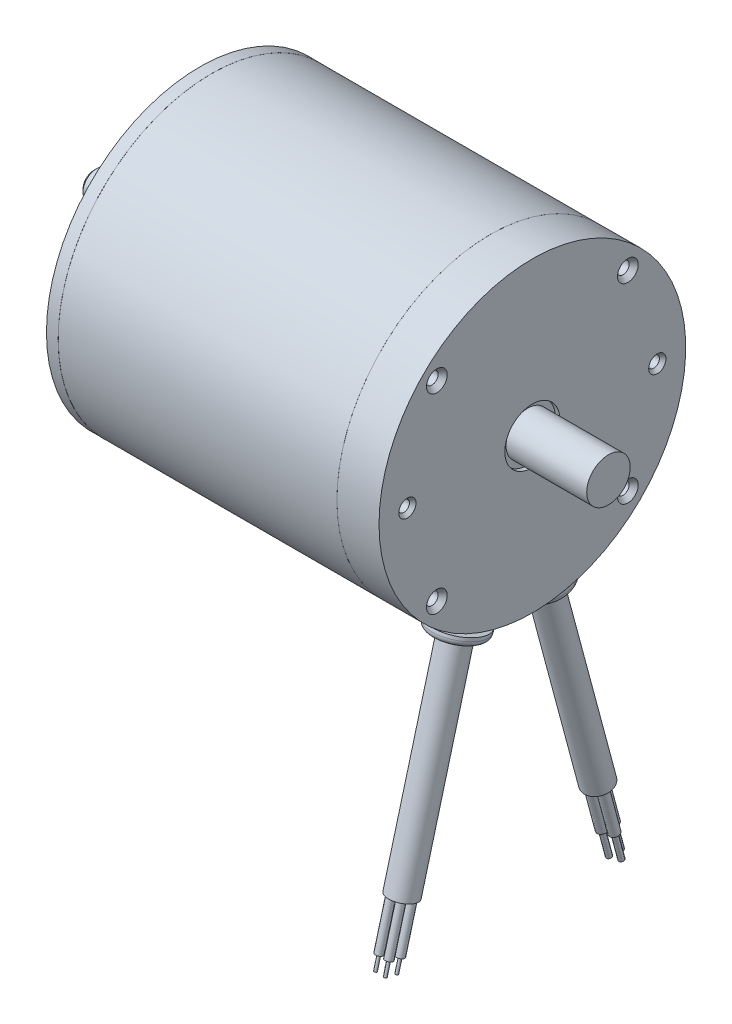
from build123d import *

# Parameters (mm, degrees)
CHAMFER1_SIZE            = 0.508
FILLET1_R                = 0.25
FILLET2_R                = 0.13
CIRPATTERN2_COUNT        = 2
CIRPATTERN3_COUNT        = 4
CIRPATTERN4_COUNT        = 4
SKETCH22_R               = 3.175
CUT_EXTRUDE2_DEPTH       = 0.75
CUT_EXTRUDE3_DEPTH       = 1.75
CIRPATTERN1_COUNT        = 4
SKETCH28_R               = 3.175
BOSS_EXTRUDE3_DEPTH      = 1.5
SKETCH29_R               = 4.7625
BOSS_EXTRUDE4_DEPTH      = 1.588
SKETCH30_R               = 2.54
BOSS_EXTRUDE5_DEPTH      = 38.291
FILLET4_R                = 1
SKETCH31_R               = 2.15
CUT_EXTRUDE4_DEPTH       = 38.291
CIRPATTERN7_COUNT        = 2
CIRPATTERN7_ANGLE        = 330
FILLET4_OF_CIRPATTERN7_R = 1
SKETCH32_R               = 0.889
BOSS_EXTRUDE6_DEPTH      = 47
SKETCH33_R               = 0.6985
BOSS_EXTRUDE7_DEPTH      = 47
SKETCH34_R               = 0.4825
BOSS_EXTRUDE8_DEPTH      = 5.08
SKETCH35_R               = 0.254
BOSS_EXTRUDE9_DEPTH      = 2.54


with BuildPart() as part:
    # Sketch1 → Revolve1 (revolve)
    with BuildSketch(Plane.XY, mode=Mode.PRIVATE) as revolve1_sk:
        Polygon((0, 0), (0, 2.5), (21.12, 2.5), (21.12, 11.006), (20.92, 11.006), (20.92, 9.4), (17.5, 9.4), (17.5, 12.5), (19.5, 12.5), (19.5, 28.22), (80.7, 28.22), (80.7, 5.08), (79.86, 5.08), (79.86, 4), (94.7, 4), (94.7, 0), align=None)
    revolve(revolve1_sk.sketch.rotate(Axis((0, 0, 0), (1, 0, 0)), 90), axis=Axis((0, 0, 0), (1, 0, 0)))

    # Chamfer1
    chamfer1_edges = [part.edges().sort_by_distance(p)[0] for p in [
        (0, 0, -2.5),
    ]]
    chamfer(chamfer1_edges, length=CHAMFER1_SIZE)

    # Fillet1
    fillet1_edges = [part.edges().sort_by_distance(p)[0] for p in [
        (17.5, 0, -12.5),
    ]]
    fillet(fillet1_edges, radius=FILLET1_R)

    # Fillet2
    fillet2_edges = [part.edges().sort_by_distance(p)[0] for p in [
        (17.5, 0, -9.4),
    ]]
    fillet(fillet2_edges, radius=FILLET2_R)

    # Sketch2 → Cut-Revolve1 (revolve, cut)
    with BuildSketch(Plane.XY, mode=Mode.PRIVATE) as cut_revolve1_sk:
        Polygon((72.9465, 28.22), (72.9535, 28.22), (72.95, 28.213937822), align=None)
        Polygon((21.663753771, 28.22), (21.66, 28.213798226), (21.656753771, 28.22), align=None)
    revolve(cut_revolve1_sk.sketch.rotate(Axis((0, 0, 0), (-1, 0, 0)), 90), axis=Axis((0, 0, 0), (-1, 0, 0)), mode=Mode.SUBTRACT)

    # Sketch25 → Cut-Revolve2 (revolve, cut)
    with BuildSketch(Plane.XY, mode=Mode.PRIVATE) as cut_revolve2_sk:
        Polygon((21.12, 6.577215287), (21.12, 5.886771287), (21.446745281, 5.560026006), (21.446745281, 2.737783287), (22.736248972, 2.737783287), (22.736248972, 2.5), (20.92, 2.5), (20.92, 9.364596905), (21.446745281, 9.364596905), (21.446745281, 6.903960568), align=None)
    revolve(cut_revolve2_sk.sketch.rotate(Axis((0, 0, 0), (-1, 0, 0)), 90), axis=Axis((0, 0, 0), (-1, 0, 0)), mode=Mode.SUBTRACT)

    # Sketch11 → 4-40 Tapped Hole2 (revolve, cut)
    with BuildSketch(Plane(origin=(80.7, 17.575139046, 17.575139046), x_dir=(0, 0, -1), z_dir=(0, 1, 0))):
        Polygon((0, 0), (0, 8.274152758), (1.1303, 7.595), (1.1303, 0.891190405), (1.905, 0), align=None)
    f_4_40_tapped_hole2 = revolve(axis=Axis((87.05, 17.575139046, 17.575139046), (-1, 0, 0)), mode=Mode.SUBTRACT)

    # Sketch15 → M2.5x0.45 Tapped Hole2 (revolve, cut)
    with BuildSketch(Plane(origin=(80.7, 0, 23), x_dir=(0, 0, -1), z_dir=(0, 1, 0))):
        Polygon((0, 0), (0, 6.965882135), (1.025, 6.35), (1.025, 0.64995815), (1.59, 0), align=None)
    m2_5x0_45_tapped_hole2 = revolve(axis=Axis((87.05, 0, 23), (-1, 0, 0)), mode=Mode.SUBTRACT)

    # CirPattern2: M2.5x0.45 Tapped Hole2 ×2 about axis
    cirpattern2_axis = Axis((0, 0, 0), (1, 0, 0))
    for i in range(1, CIRPATTERN2_COUNT):
        add(m2_5x0_45_tapped_hole2.rotate(cirpattern2_axis, i * 360 / CIRPATTERN2_COUNT), mode=Mode.SUBTRACT)

    # CirPattern3: 4-40 Tapped Hole2 ×4 about axis
    cirpattern3_axis = Axis((0, 0, 0), (1, 0, 0))
    for i in range(1, CIRPATTERN3_COUNT):
        add(f_4_40_tapped_hole2.rotate(cirpattern3_axis, i * 360 / CIRPATTERN3_COUNT), mode=Mode.SUBTRACT)

    # Sketch18 → M4x0.7 Tapped Hole1 (revolve, cut)
    with BuildSketch(Plane(origin=(19.5, 21, 0), x_dir=(0, 0, 1), z_dir=(0, 1, 0))):
        Polygon((0, 0), (0, 11.091420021), (1.65, 10.1), (1.65, 0.431388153), (2.025, 0), align=None)
    m4x0_7_tapped_hole1 = revolve(axis=Axis((13.15, 21, 0), (1, 0, 0)), mode=Mode.SUBTRACT)

    # CirPattern4: M4x0.7 Tapped Hole1 ×4 about axis
    cirpattern4_axis = Axis((0, 0, 0), (1, 0, 0))
    for i in range(1, CIRPATTERN4_COUNT):
        add(m4x0_7_tapped_hole1.rotate(cirpattern4_axis, i * 360 / CIRPATTERN4_COUNT), mode=Mode.SUBTRACT)

    # Sketch22 → Cut-Extrude2 (cut)
    with BuildSketch(Plane.ZY.offset(-19.5)):
        with Locations((17.575139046, 17.575139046)):
            Circle(SKETCH22_R)
    cut_extrude2 = extrude(amount=-CUT_EXTRUDE2_DEPTH, mode=Mode.SUBTRACT)

    # Sketch23 → Cut-Extrude3 (cut)
    with BuildSketch(Plane.ZY.offset(-20.25)):
        with BuildLine():
            Line((17.064231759, 18.651731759), (16.605413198, 19.11055032))
            ThreePointArc((16.605413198, 19.11055032), (16.291033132, 18.859244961), (16.039727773, 18.544864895))
            Line((16.039727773, 18.544864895), (16.498546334, 18.086046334))
            ThreePointArc((16.498546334, 18.086046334), (16.628532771, 17.908767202), (16.699194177, 17.700605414))
            Line((16.699194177, 17.700605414), (15.987639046, 17.575139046))
            Line((15.987639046, 17.575139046), (16.699194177, 17.449672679))
            ThreePointArc((16.699194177, 17.449672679), (16.628532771, 17.24151089), (16.498546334, 17.064231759))
            Line((16.498546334, 17.064231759), (16.039727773, 16.605413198))
            ThreePointArc((16.039727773, 16.605413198), (16.291033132, 16.291033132), (16.605413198, 16.039727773))
            Line((16.605413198, 16.039727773), (17.064231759, 16.498546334))
            ThreePointArc((17.064231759, 16.498546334), (17.238958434, 16.627197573), (17.444003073, 16.698171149))
            Line((17.444003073, 16.698171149), (17.575139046, 15.987639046))
            Line((17.575139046, 15.987639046), (17.706275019, 16.698171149))
            ThreePointArc((17.706275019, 16.698171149), (17.911319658, 16.627197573), (18.086046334, 16.498546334))
            Line((18.086046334, 16.498546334), (18.544864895, 16.039727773))
            ThreePointArc((18.544864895, 16.039727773), (18.859244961, 16.291033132), (19.11055032, 16.605413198))
            Line((19.11055032, 16.605413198), (18.651731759, 17.064231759))
            ThreePointArc((18.651731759, 17.064231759), (18.521745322, 17.24151089), (18.451083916, 17.449672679))
            Line((18.451083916, 17.449672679), (19.162639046, 17.575139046))
            Line((19.162639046, 17.575139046), (18.451083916, 17.700605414))
            ThreePointArc((18.451083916, 17.700605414), (18.521745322, 17.908767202), (18.651731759, 18.086046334))
            Line((18.651731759, 18.086046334), (19.11055032, 18.544864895))
            ThreePointArc((19.11055032, 18.544864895), (18.859244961, 18.859244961), (18.544864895, 19.11055032))
            Line((18.544864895, 19.11055032), (18.086046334, 18.651731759))
            ThreePointArc((18.086046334, 18.651731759), (17.911319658, 18.52308052), (17.706275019, 18.452106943))
            Line((17.706275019, 18.452106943), (17.575139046, 19.162639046))
            Line((17.575139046, 19.162639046), (17.444003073, 18.452106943))
            ThreePointArc((17.444003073, 18.452106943), (17.238958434, 18.52308052), (17.064231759, 18.651731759))
        make_face()
    cut_extrude3 = extrude(amount=-CUT_EXTRUDE3_DEPTH, mode=Mode.SUBTRACT)

    # CirPattern1: Cut-Extrude2, Cut-Extrude3 ×4 about axis
    cirpattern1_axis = Axis((0, 0, 0), (1, 0, 0))
    add([cut_extrude2.rotate(cirpattern1_axis, i * 360 / CIRPATTERN1_COUNT) for i in range(1, CIRPATTERN1_COUNT)], mode=Mode.SUBTRACT)
    add([cut_extrude3.rotate(cirpattern1_axis, i * 360 / CIRPATTERN1_COUNT) for i in range(1, CIRPATTERN1_COUNT)], mode=Mode.SUBTRACT)

    # Sketch26 → Revolve2 (revolve)
    with BuildSketch(Plane(origin=(0, 0, 0), x_dir=(1, 0, 0), z_dir=(0, 1, 0))):
        Polygon((21.446745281, 2.737783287), (21.12, 3.064528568), (21.12, 3.591970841), (21.446745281, 3.918716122), align=None)
    revolve(axis=Axis((0, 0, 0), (-1, 0, 0)))

    # Sketch28 → Boss-Extrude3 (add, symmetric)
    with BuildSketch(Plane(origin=(0, -27.258426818, 7.303873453), x_dir=(1, 0, 0), z_dir=(0, -0.9659258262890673, 0.25881904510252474))):
        with Locations(Location((74.712551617, 0, 0), (0, 0, 123.644067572))):
            Circle(SKETCH28_R)
    boss_extrude3 = extrude(amount=BOSS_EXTRUDE3_DEPTH, both=True)

    # Sketch29 → Boss-Extrude4 (add)
    with BuildSketch(Plane(origin=(0, -28.707315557, 7.69210202), x_dir=(1, 0, 0), z_dir=(0, -0.9659258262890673, 0.2588190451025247))):
        with Locations(Location((74.712551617, 0, 0), (0, 0, 270))):
            Circle(SKETCH29_R)
    boss_extrude4 = extrude(amount=BOSS_EXTRUDE4_DEPTH)

    # Sketch30 → Boss-Extrude5 (add)
    with BuildSketch(Plane(origin=(0, -30.241205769, 8.103106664), x_dir=(1, 0, 0), z_dir=(0, -0.9659258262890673, 0.25881904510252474))):
        with Locations(Location((74.712551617, 0, 0), (0, 0, 270))):
            Circle(SKETCH30_R)
    boss_extrude5 = extrude(amount=BOSS_EXTRUDE5_DEPTH)

    # Fillet4
    fillet4_edges = [part.edges().sort_by_distance(p)[0] for p in [
        (74.712551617, -29.008580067, 12.703328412),
    ]]
    fillet(fillet4_edges, radius=FILLET4_R)

    # Sketch31 → Cut-Extrude4 (cut)
    with BuildSketch(Plane(origin=(0, -67.227471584, 18.01354672), x_dir=(1, 0, 0), z_dir=(0, -0.9659258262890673, 0.2588190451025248))):
        with Locations(Location((74.712551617, 0, 0), (0, 0, 270))):
            Circle(SKETCH31_R)
    cut_extrude4 = extrude(amount=-CUT_EXTRUDE4_DEPTH, mode=Mode.SUBTRACT)

    # CirPattern7: Boss-Extrude3, Boss-Extrude4, Boss-Extrude5, Cut-Extrude4 ×2 about axis
    cirpattern7_axis = Axis((0, 0, 0), (-1, 0, 0))
    add([boss_extrude3.rotate(cirpattern7_axis, i * CIRPATTERN7_ANGLE / (CIRPATTERN7_COUNT - 1)) for i in range(1, CIRPATTERN7_COUNT)])
    add([boss_extrude4.rotate(cirpattern7_axis, i * CIRPATTERN7_ANGLE / (CIRPATTERN7_COUNT - 1)) for i in range(1, CIRPATTERN7_COUNT)])
    add([boss_extrude5.rotate(cirpattern7_axis, i * CIRPATTERN7_ANGLE / (CIRPATTERN7_COUNT - 1)) for i in range(1, CIRPATTERN7_COUNT)])
    add([cut_extrude4.rotate(cirpattern7_axis, i * CIRPATTERN7_ANGLE / (CIRPATTERN7_COUNT - 1)) for i in range(1, CIRPATTERN7_COUNT)], mode=Mode.SUBTRACT)

    # Fillet4 of CirPattern7
    fillet4_of_cirpattern7_edges = [part.edges().sort_by_distance(p)[0] for p in [
        (74.712551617, -31.473831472, -3.502884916),
    ]]
    fillet(fillet4_of_cirpattern7_edges, radius=FILLET4_OF_CIRPATTERN7_R)

    # Sketch32 → Boss-Extrude6 (add)
    with BuildSketch(Plane(origin=(0, -30.241205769, -8.103106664), x_dir=(1, 0, 0), z_dir=(0, -0.9659258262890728, -0.2588190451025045))):
        with Locations(Location((73.976490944, 0.779203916, 0), (0, 0, 270))):
            Circle(SKETCH32_R)
        with Locations(Location((74.405771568, -1.027049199, 0), (0, 0, 270))):
            Circle(SKETCH32_R)
        with Locations(Location((75.755392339, 0.247845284, 0), (0, 0, 270))):
            Circle(SKETCH32_R)
    extrude(amount=BOSS_EXTRUDE6_DEPTH)

    # Sketch33 → Boss-Extrude7 (add)
    with BuildSketch(Plane(origin=(0, -30.241205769, 8.103106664), x_dir=(1, 0, 0), z_dir=(0, -0.9659258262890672, 0.25881904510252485))):
        with Locations(Location((74.712551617, 0, 0), (0, 0, 270))):
            Circle(SKETCH33_R)
        with Locations(Location((73.804246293, 1.091960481, 0), (0, 0, 270))):
            Circle(SKETCH33_R)
        with Locations(Location((75.615786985, 1.091960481, 0), (0, 0, 270))):
            Circle(SKETCH33_R)
        with Locations(Location((75.615786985, -1.088724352, 0), (0, 0, 270))):
            Circle(SKETCH33_R)
        with Locations(Location((73.804246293, -1.088724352, 0), (0, 0, 270))):
            Circle(SKETCH33_R)
    extrude(amount=BOSS_EXTRUDE7_DEPTH)

    # Sketch34 → Boss-Extrude8 (add)
    with BuildSketch(Plane(origin=(0, -75.639719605, -20.267601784), x_dir=(1, 0, 0), z_dir=(0, -0.9659258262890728, -0.25881904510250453))):
        with Locations(Location((75.755392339, 0.247845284, 0), (0, 0, 270))):
            Circle(SKETCH34_R)
        with Locations(Location((73.976490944, 0.779203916, 0), (0, 0, 270))):
            Circle(SKETCH34_R)
        with Locations(Location((74.405771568, -1.027049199, 0), (0, 0, 270))):
            Circle(SKETCH34_R)
    extrude(amount=BOSS_EXTRUDE8_DEPTH)

    # Sketch35 → Boss-Extrude9 (add)
    with BuildSketch(Plane(origin=(0, -75.639719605, 20.267601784), x_dir=(1, 0, 0), z_dir=(0, -0.9659258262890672, 0.25881904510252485))):
        with Locations(Location((75.615786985, -1.088724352, 0), (0, 0, 270))):
            Circle(SKETCH35_R)
        with Locations(Location((73.804246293, -1.088724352, 0), (0, 0, 270))):
            Circle(SKETCH35_R)
        with Locations(Location((74.712551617, 0, 0), (0, 0, 270))):
            Circle(SKETCH35_R)
        with Locations(Location((73.804246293, 1.091960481, 0), (0, 0, 270))):
            Circle(SKETCH35_R)
        with Locations(Location((75.615786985, 1.091960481, 0), (0, 0, 270))):
            Circle(SKETCH35_R)
    extrude(amount=BOSS_EXTRUDE9_DEPTH)


solid = part.part
